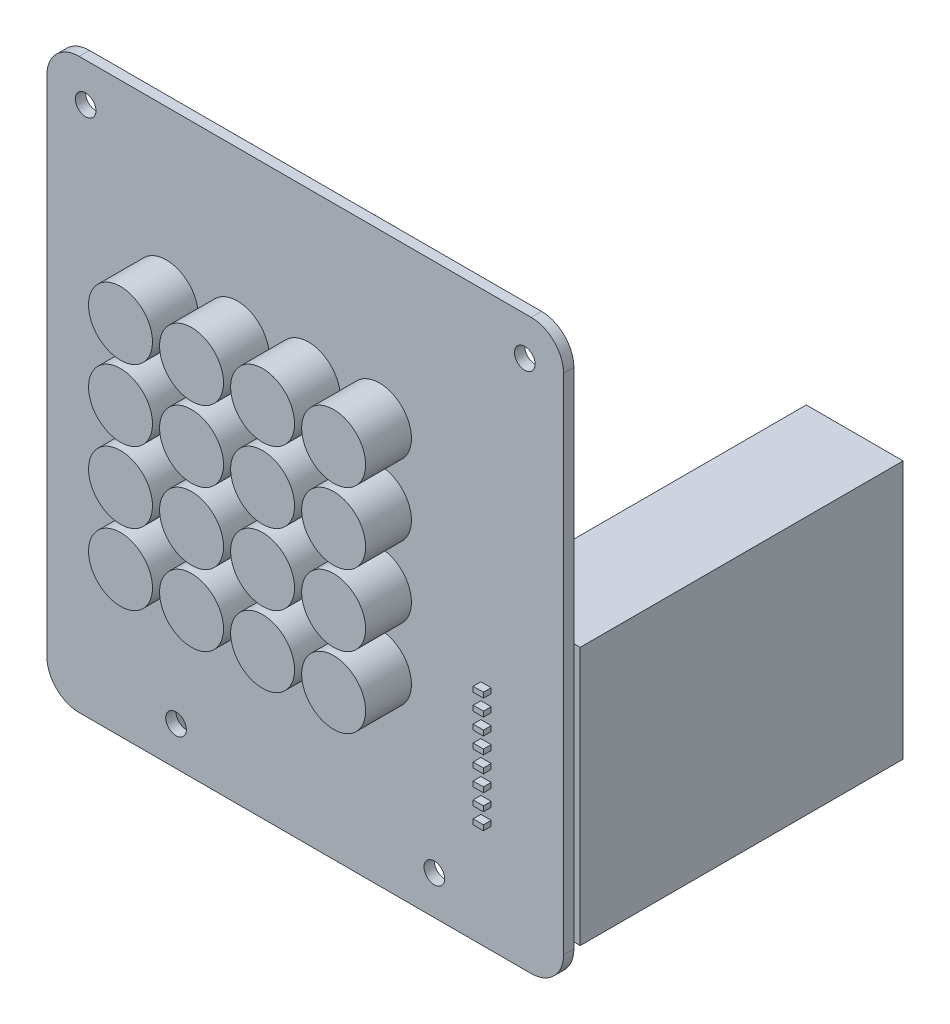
from build123d import *

# Parameters (mm, degrees)
SOURCE_PCB_OUTLINE_AND_HOLES_START             = -1.6
SKETCH_1_R                                     = 1.59999934
SOURCE_PCB_OUTLINE_AND_HOLES_DEPTH             = 1.6
NOMINAL_20MM_CAPACITOR_C1_START                = -21.6
SKETCH_2_R                                     = 6.25
NOMINAL_20MM_CAPACITOR_C1_DEPTH                = 20
ACOUSTIC_CASES_0_START                         = 3.5
SKETCH_3_R                                     = 4.95
ACOUSTIC_CASES_0_DEPTH                         = 7.1
ACOUSTIC_CASES_0_2_DEPTH                       = 7.1
ACOUSTIC_CASES_0_3_DEPTH                       = 7.1
ACOUSTIC_CASES_0_4_DEPTH                       = 7.1
ACOUSTIC_CASES_0_5_DEPTH                       = 7.1
ACOUSTIC_CASES_0_6_DEPTH                       = 7.1
ACOUSTIC_CASES_0_7_DEPTH                       = 7.1
ACOUSTIC_CASES_0_8_DEPTH                       = 7.1
ACOUSTIC_CASES_8_START                         = 3.5
SKETCH_4_R                                     = 4.95
ACOUSTIC_CASES_8_DEPTH                         = 7.1
ACOUSTIC_CASES_8_2_DEPTH                       = 7.1
ACOUSTIC_CASES_8_3_DEPTH                       = 7.1
ACOUSTIC_CASES_8_4_DEPTH                       = 7.1
ACOUSTIC_CASES_8_5_DEPTH                       = 7.1
ACOUSTIC_CASES_8_6_DEPTH                       = 7.1
ACOUSTIC_CASES_8_7_DEPTH                       = 7.1
ACOUSTIC_CASES_8_8_DEPTH                       = 7.1
COMPONENT_ENVELOPES_1_1_START                  = -2.9
SKETCH_5_W                                     = 1.999996
SKETCH_5_H                                     = 1.249985
COMPONENT_ENVELOPES_1_1_DEPTH                  = 1.3
COMPONENT_ENVELOPES_1_1_2_DEPTH                = 1.3
COMPONENT_ENVELOPES_1_1_3_DEPTH                = 1.3
COMPONENT_ENVELOPES_1_1_4_DEPTH                = 1.3
SKETCH_5_W_2                                   = 1.249985
SKETCH_5_H_2                                   = 1.999996
COMPONENT_ENVELOPES_1_1_5_DEPTH                = 1.3
COMPONENT_ENVELOPES_1_1_6_DEPTH                = 1.3
COMPONENT_ENVELOPES_1_1_7_DEPTH                = 1.3
COMPONENT_ENVELOPES_1_1_8_DEPTH                = 1.3
COMPONENT_ENVELOPES_1_2_START                  = -2.9
SKETCH_6_W                                     = 1.999996
SKETCH_6_H                                     = 1.249985
COMPONENT_ENVELOPES_1_2_DEPTH                  = 1.3
COMPONENT_ENVELOPES_1_2_2_DEPTH                = 1.3
COMPONENT_ENVELOPES_1_2_3_DEPTH                = 1.3
COMPONENT_ENVELOPES_1_2_4_DEPTH                = 1.3
SKETCH_6_W_2                                   = 1.249985
SKETCH_6_H_2                                   = 1.999996
COMPONENT_ENVELOPES_1_2_5_DEPTH                = 1.3
COMPONENT_ENVELOPES_1_2_6_DEPTH                = 1.3
COMPONENT_ENVELOPES_1_2_7_DEPTH                = 1.3
COMPONENT_ENVELOPES_1_2_8_DEPTH                = 1.3
COMPONENT_ENVELOPES_2_1_START                  = -16.6
SKETCH_7_W                                     = 8.799982
SKETCH_7_H                                     = 32.999934
COMPONENT_ENVELOPES_2_1_DEPTH                  = 15
COMPONENT_ENVELOPES_3_1_START                  = -2.8
SKETCH_8_W                                     = 1.599997
SKETCH_8_H                                     = 0.799998
COMPONENT_ENVELOPES_3_1_DEPTH                  = 1.2
COMPONENT_ENVELOPES_3_1_2_DEPTH                = 1.2
COMPONENT_ENVELOPES_3_1_3_DEPTH                = 1.2
COMPONENT_ENVELOPES_3_1_4_DEPTH                = 1.2
COMPONENT_ENVELOPES_3_1_5_DEPTH                = 1.2
COMPONENT_ENVELOPES_3_1_6_DEPTH                = 1.2
COMPONENT_ENVELOPES_3_1_7_DEPTH                = 1.2
COMPONENT_ENVELOPES_3_1_8_DEPTH                = 1.2
COMPONENT_ENVELOPES_3_2_START                  = -2.8
SKETCH_9_W                                     = 1.599997
SKETCH_9_H                                     = 0.799998
COMPONENT_ENVELOPES_3_2_DEPTH                  = 1.2
COMPONENT_ENVELOPES_3_2_2_DEPTH                = 1.2
COMPONENT_ENVELOPES_3_2_3_DEPTH                = 1.2
COMPONENT_ENVELOPES_3_2_4_DEPTH                = 1.2
SKETCH_9_W_2                                   = 0.799998
SKETCH_9_H_2                                   = 1.599997
COMPONENT_ENVELOPES_3_2_5_DEPTH                = 1.2
COMPONENT_ENVELOPES_3_2_6_DEPTH                = 1.2
COMPONENT_ENVELOPES_3_2_7_DEPTH                = 1.2
COMPONENT_ENVELOPES_3_2_8_DEPTH                = 1.2
COMPONENT_ENVELOPES_3_3_START                  = -2.8
SKETCH_10_W                                    = 0.799998
SKETCH_10_H                                    = 1.599997
COMPONENT_ENVELOPES_3_3_DEPTH                  = 1.2
COMPONENT_ENVELOPES_3_3_2_DEPTH                = 1.2
COMPONENT_ENVELOPES_3_3_3_DEPTH                = 1.2
COMPONENT_ENVELOPES_3_3_4_DEPTH                = 1.2
SKETCH_10_W_2                                  = 1.599997
SKETCH_10_H_2                                  = 0.799998
COMPONENT_ENVELOPES_3_3_5_DEPTH                = 1.2
COMPONENT_ENVELOPES_3_3_6_DEPTH                = 1.2
COMPONENT_ENVELOPES_3_3_7_DEPTH                = 1.2
COMPONENT_ENVELOPES_3_3_8_DEPTH                = 1.2
SKETCH_11_W                                    = 1.599997
SKETCH_11_H                                    = 0.799998
COMPONENT_ENVELOPES_4_1_DEPTH                  = 1.2
COMPONENT_ENVELOPES_4_1_2_DEPTH                = 1.2
COMPONENT_ENVELOPES_4_1_3_DEPTH                = 1.2
COMPONENT_ENVELOPES_4_1_4_DEPTH                = 1.2
COMPONENT_ENVELOPES_4_1_5_DEPTH                = 1.2
COMPONENT_ENVELOPES_4_1_6_DEPTH                = 1.2
COMPONENT_ENVELOPES_4_1_7_DEPTH                = 1.2
COMPONENT_ENVELOPES_4_1_8_DEPTH                = 1.2
COMPONENT_ENVELOPES_5_1_START                  = -3.3
SKETCH_12_W                                    = 3.042818
SKETCH_12_H                                    = 5.052416
COMPONENT_ENVELOPES_5_1_DEPTH                  = 1.7
COMPONENT_ENVELOPES_5_1_2_DEPTH                = 1.7
SKETCH_12_W_2                                  = 5.052416
SKETCH_12_H_2                                  = 3.042818
COMPONENT_ENVELOPES_5_1_3_DEPTH                = 1.7
COMPONENT_ENVELOPES_5_1_4_DEPTH                = 1.7
COMPONENT_ENVELOPES_5_1_5_DEPTH                = 1.7
COMPONENT_ENVELOPES_5_1_6_DEPTH                = 1.7
COMPONENT_ENVELOPES_5_1_7_DEPTH                = 1.7
COMPONENT_ENVELOPES_5_1_8_DEPTH                = 1.7
COMPONENT_ENVELOPES_6_1_START                  = -4.3
SKETCH_13_W                                    = 6.100013
SKETCH_13_H                                    = 2.690012
COMPONENT_ENVELOPES_6_1_DEPTH                  = 2.7
COMPONENT_ENVELOPES_7_1_START                  = -3.1
SKETCH_14_W                                    = 4.599991
SKETCH_14_H                                    = 3.599993
COMPONENT_ENVELOPES_7_1_DEPTH                  = 1.5
SKETCH_14_W_2                                  = 12.999974
SKETCH_14_H_2                                  = 4.79999
COMPONENT_ENVELOPES_7_1_2_DEPTH                = 1.5
COMPONENT_ENVELOPES_8_1_START                  = -11.6
SKETCH_15_W                                    = 13.299973
SKETCH_15_H                                    = 11.892357
COMPONENT_ENVELOPES_8_1_DEPTH                  = 10
ASSUMED_WIRED_CONNECTOR_BACK_KEEPOUT_50M_START = -51.6
SKETCH_16_W                                    = 15
SKETCH_16_H                                    = 40
ASSUMED_WIRED_CONNECTOR_BACK_KEEPOUT_50M_DEPTH = 50


with BuildPart() as part:
    # Sketch 1 → Source_PCB_outline_and_holes (new body)
    with BuildSketch(Plane.XY.offset(SOURCE_PCB_OUTLINE_AND_HOLES_START)):
        with BuildLine():
            Line((-33.5, -49.49999926), (36.50000002, -49.49999926))
            ThreePointArc((36.50000002, -49.49999926), (40.035533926, -48.035533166), (41.50000002, -44.49999926))
            Line((41.50000002, -44.49999926), (41.50000002, 33.5))
            ThreePointArc((41.50000002, 33.5), (40.035533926, 37.035533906), (36.50000002, 38.5))
            Line((36.50000002, 38.5), (-33.5, 38.5))
            ThreePointArc((-33.5, 38.5), (-37.035533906, 37.035533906), (-38.5, 33.5))
            Line((-38.5, 33.5), (-38.5, -44.49999926))
            ThreePointArc((-38.5, -44.49999926), (-37.035533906, -48.035533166), (-33.5, -49.49999926))
        make_face()
        with Locations((-32.499999, 32.499999)):
            Circle(SKETCH_1_R, mode=Mode.SUBTRACT)
        with Locations((35.500002, 32.499999)):
            Circle(SKETCH_1_R, mode=Mode.SUBTRACT)
        with Locations((21.500002, -43.500001)):
            Circle(SKETCH_1_R, mode=Mode.SUBTRACT)
        with Locations((-18.499999, -43.500001)):
            Circle(SKETCH_1_R, mode=Mode.SUBTRACT)
    extrude(amount=SOURCE_PCB_OUTLINE_AND_HOLES_DEPTH)


with BuildPart() as body_2:
    # Sketch 2 → Nominal_20mm_capacitor_C1 (new body)
    with BuildSketch(Plane.XY.offset(NOMINAL_20MM_CAPACITOR_C1_START)):
        with Locations((-29.023999, -20.760001)):
            Circle(SKETCH_2_R)
    extrude(amount=NOMINAL_20MM_CAPACITOR_C1_DEPTH)


with BuildPart() as body_3:
    # Sketch 3 → Acoustic_cases_0 (new body)
    with BuildSketch(Plane.XY.offset(ACOUSTIC_CASES_0_START)):
        with Locations((-16.499671, 16.499998)):
            Circle(SKETCH_3_R)
    extrude(amount=ACOUSTIC_CASES_0_DEPTH)


with BuildPart() as body_4:
    # Sketch 3 → Acoustic_cases_0 2 (new body)
    with BuildSketch(Plane.XY.offset(ACOUSTIC_CASES_0_START)):
        with Locations((-5.499568, 16.499998)):
            Circle(SKETCH_3_R)
    extrude(amount=ACOUSTIC_CASES_0_2_DEPTH)


with BuildPart() as body_5:
    # Sketch 3 → Acoustic_cases_0 3 (new body)
    with BuildSketch(Plane.XY.offset(ACOUSTIC_CASES_0_START)):
        with Locations((5.499983, 16.499998)):
            Circle(SKETCH_3_R)
    extrude(amount=ACOUSTIC_CASES_0_3_DEPTH)


with BuildPart() as body_6:
    # Sketch 3 → Acoustic_cases_0 4 (new body)
    with BuildSketch(Plane.XY.offset(ACOUSTIC_CASES_0_START)):
        with Locations((16.499814, 16.499998)):
            Circle(SKETCH_3_R)
    extrude(amount=ACOUSTIC_CASES_0_4_DEPTH)


with BuildPart() as body_7:
    # Sketch 3 → Acoustic_cases_0 5 (new body)
    with BuildSketch(Plane.XY.offset(ACOUSTIC_CASES_0_START)):
        with Locations((-16.49993, 5.5)):
            Circle(SKETCH_3_R)
    extrude(amount=ACOUSTIC_CASES_0_5_DEPTH)


with BuildPart() as body_8:
    # Sketch 3 → Acoustic_cases_0 6 (new body)
    with BuildSketch(Plane.XY.offset(ACOUSTIC_CASES_0_START)):
        with Locations((-5.499782, 5.5)):
            Circle(SKETCH_3_R)
    extrude(amount=ACOUSTIC_CASES_0_6_DEPTH)


with BuildPart() as body_9:
    # Sketch 3 → Acoustic_cases_0 7 (new body)
    with BuildSketch(Plane.XY.offset(ACOUSTIC_CASES_0_START)):
        with Locations((5.500293, 5.5)):
            Circle(SKETCH_3_R)
    extrude(amount=ACOUSTIC_CASES_0_7_DEPTH)


with BuildPart() as body_10:
    # Sketch 3 → Acoustic_cases_0 8 (new body)
    with BuildSketch(Plane.XY.offset(ACOUSTIC_CASES_0_START)):
        with Locations((16.499953, 5.5)):
            Circle(SKETCH_3_R)
    extrude(amount=ACOUSTIC_CASES_0_8_DEPTH)


with BuildPart() as body_11:
    # Sketch 4 → Acoustic_cases_8 (new body)
    with BuildSketch(Plane.XY.offset(ACOUSTIC_CASES_8_START)):
        with Locations((-16.499998, -5.500001)):
            Circle(SKETCH_4_R)
    extrude(amount=ACOUSTIC_CASES_8_DEPTH)


with BuildPart() as body_12:
    # Sketch 4 → Acoustic_cases_8 2 (new body)
    with BuildSketch(Plane.XY.offset(ACOUSTIC_CASES_8_START)):
        with Locations((-5.499665, -5.500001)):
            Circle(SKETCH_4_R)
    extrude(amount=ACOUSTIC_CASES_8_2_DEPTH)


with BuildPart() as body_13:
    # Sketch 4 → Acoustic_cases_8 3 (new body)
    with BuildSketch(Plane.XY.offset(ACOUSTIC_CASES_8_START)):
        with Locations((5.499668, -5.500001)):
            Circle(SKETCH_4_R)
    extrude(amount=ACOUSTIC_CASES_8_3_DEPTH)


with BuildPart() as body_14:
    # Sketch 4 → Acoustic_cases_8 4 (new body)
    with BuildSketch(Plane.XY.offset(ACOUSTIC_CASES_8_START)):
        with Locations((16.499953, -5.500001)):
            Circle(SKETCH_4_R)
    extrude(amount=ACOUSTIC_CASES_8_4_DEPTH)


with BuildPart() as body_15:
    # Sketch 4 → Acoustic_cases_8 5 (new body)
    with BuildSketch(Plane.XY.offset(ACOUSTIC_CASES_8_START)):
        with Locations((-16.499998, -16.500002)):
            Circle(SKETCH_4_R)
    extrude(amount=ACOUSTIC_CASES_8_5_DEPTH)


with BuildPart() as body_16:
    # Sketch 4 → Acoustic_cases_8 6 (new body)
    with BuildSketch(Plane.XY.offset(ACOUSTIC_CASES_8_START)):
        with Locations((-5.499782, -16.500002)):
            Circle(SKETCH_4_R)
    extrude(amount=ACOUSTIC_CASES_8_6_DEPTH)


with BuildPart() as body_17:
    # Sketch 4 → Acoustic_cases_8 7 (new body)
    with BuildSketch(Plane.XY.offset(ACOUSTIC_CASES_8_START)):
        with Locations((5.500293, -16.500002)):
            Circle(SKETCH_4_R)
    extrude(amount=ACOUSTIC_CASES_8_7_DEPTH)


with BuildPart() as body_18:
    # Sketch 4 → Acoustic_cases_8 8 (new body)
    with BuildSketch(Plane.XY.offset(ACOUSTIC_CASES_8_START)):
        with Locations((16.499953, -16.500002)):
            Circle(SKETCH_4_R)
    extrude(amount=ACOUSTIC_CASES_8_8_DEPTH)


with BuildPart() as body_19:
    # Sketch 5 → Component_envelopes_1_1 (new body)
    with BuildSketch(Plane.XY.offset(COMPONENT_ENVELOPES_1_1_START)):
        with Locations((-31.563999, 2.9889995)):
            Rectangle(SKETCH_5_W, SKETCH_5_H)
    extrude(amount=COMPONENT_ENVELOPES_1_1_DEPTH)


with BuildPart() as body_20:
    # Sketch 5 → Component_envelopes_1_1 2 (new body)
    with BuildSketch(Plane.XY.offset(COMPONENT_ENVELOPES_1_1_START)):
        with Locations((-31.563999, 5.4019995)):
            Rectangle(SKETCH_5_W, SKETCH_5_H)
    extrude(amount=COMPONENT_ENVELOPES_1_1_2_DEPTH)


with BuildPart() as body_21:
    # Sketch 5 → Component_envelopes_1_1 3 (new body)
    with BuildSketch(Plane.XY.offset(COMPONENT_ENVELOPES_1_1_START)):
        with Locations((26.221001, -6.0280005)):
            Rectangle(SKETCH_5_W, SKETCH_5_H)
    extrude(amount=COMPONENT_ENVELOPES_1_1_3_DEPTH)


with BuildPart() as body_22:
    # Sketch 5 → Component_envelopes_1_1 4 (new body)
    with BuildSketch(Plane.XY.offset(COMPONENT_ENVELOPES_1_1_START)):
        with Locations((26.221001, -8.5680005)):
            Rectangle(SKETCH_5_W, SKETCH_5_H)
    extrude(amount=COMPONENT_ENVELOPES_1_1_4_DEPTH)


with BuildPart() as body_23:
    # Sketch 5 → Component_envelopes_1_1 5 (new body)
    with BuildSketch(Plane.XY.offset(COMPONENT_ENVELOPES_1_1_START)):
        with Locations((-10.8629995, -35.492001)):
            Rectangle(SKETCH_5_W_2, SKETCH_5_H_2)
    extrude(amount=COMPONENT_ENVELOPES_1_1_5_DEPTH)


with BuildPart() as body_24:
    # Sketch 5 → Component_envelopes_1_1 6 (new body)
    with BuildSketch(Plane.XY.offset(COMPONENT_ENVELOPES_1_1_START)):
        with Locations((-7.8149995, -35.492001)):
            Rectangle(SKETCH_5_W_2, SKETCH_5_H_2)
    extrude(amount=COMPONENT_ENVELOPES_1_1_6_DEPTH)


with BuildPart() as body_25:
    # Sketch 5 → Component_envelopes_1_1 7 (new body)
    with BuildSketch(Plane.XY.offset(COMPONENT_ENVELOPES_1_1_START)):
        with Locations((11.3620005, -35.492001)):
            Rectangle(SKETCH_5_W_2, SKETCH_5_H_2)
    extrude(amount=COMPONENT_ENVELOPES_1_1_7_DEPTH)


with BuildPart() as body_26:
    # Sketch 5 → Component_envelopes_1_1 8 (new body)
    with BuildSketch(Plane.XY.offset(COMPONENT_ENVELOPES_1_1_START)):
        with Locations((14.5370005, -35.492001)):
            Rectangle(SKETCH_5_W_2, SKETCH_5_H_2)
    extrude(amount=COMPONENT_ENVELOPES_1_1_8_DEPTH)


with BuildPart() as body_27:
    # Sketch 6 → Component_envelopes_1_2 (new body)
    with BuildSketch(Plane.XY.offset(COMPONENT_ENVELOPES_1_2_START)):
        with Locations((26.221001, 6.4179995)):
            Rectangle(SKETCH_6_W, SKETCH_6_H)
    extrude(amount=COMPONENT_ENVELOPES_1_2_DEPTH)


with BuildPart() as body_28:
    # Sketch 6 → Component_envelopes_1_2 2 (new body)
    with BuildSketch(Plane.XY.offset(COMPONENT_ENVELOPES_1_2_START)):
        with Locations((26.221001, 3.6239995)):
            Rectangle(SKETCH_6_W, SKETCH_6_H)
    extrude(amount=COMPONENT_ENVELOPES_1_2_2_DEPTH)


with BuildPart() as body_29:
    # Sketch 6 → Component_envelopes_1_2 3 (new body)
    with BuildSketch(Plane.XY.offset(COMPONENT_ENVELOPES_1_2_START)):
        with Locations((-31.563999, 15.6889995)):
            Rectangle(SKETCH_6_W, SKETCH_6_H)
    extrude(amount=COMPONENT_ENVELOPES_1_2_3_DEPTH)


with BuildPart() as body_30:
    # Sketch 6 → Component_envelopes_1_2 4 (new body)
    with BuildSketch(Plane.XY.offset(COMPONENT_ENVELOPES_1_2_START)):
        with Locations((-31.563999, 18.4829995)):
            Rectangle(SKETCH_6_W, SKETCH_6_H)
    extrude(amount=COMPONENT_ENVELOPES_1_2_4_DEPTH)


with BuildPart() as body_31:
    # Sketch 6 → Component_envelopes_1_2 5 (new body)
    with BuildSketch(Plane.XY.offset(COMPONENT_ENVELOPES_1_2_START)):
        with Locations((5.6470005, 31.436999)):
            Rectangle(SKETCH_6_W_2, SKETCH_6_H_2)
    extrude(amount=COMPONENT_ENVELOPES_1_2_5_DEPTH)


with BuildPart() as body_32:
    # Sketch 6 → Component_envelopes_1_2 6 (new body)
    with BuildSketch(Plane.XY.offset(COMPONENT_ENVELOPES_1_2_START)):
        with Locations((3.1070005, 31.436999)):
            Rectangle(SKETCH_6_W_2, SKETCH_6_H_2)
    extrude(amount=COMPONENT_ENVELOPES_1_2_6_DEPTH)


with BuildPart() as body_33:
    # Sketch 6 → Component_envelopes_1_2 7 (new body)
    with BuildSketch(Plane.XY.offset(COMPONENT_ENVELOPES_1_2_START)):
        with Locations((-15.5619995, 31.436999)):
            Rectangle(SKETCH_6_W_2, SKETCH_6_H_2)
    extrude(amount=COMPONENT_ENVELOPES_1_2_7_DEPTH)


with BuildPart() as body_34:
    # Sketch 6 → Component_envelopes_1_2 8 (new body)
    with BuildSketch(Plane.XY.offset(COMPONENT_ENVELOPES_1_2_START)):
        with Locations((-18.1019995, 31.436999)):
            Rectangle(SKETCH_6_W_2, SKETCH_6_H_2)
    extrude(amount=COMPONENT_ENVELOPES_1_2_8_DEPTH)


with BuildPart() as body_35:
    # Sketch 7 → Component_envelopes_2_1 (new body)
    with BuildSketch(Plane.XY.offset(COMPONENT_ENVELOPES_2_1_START)):
        with Locations((34.984001, -23.554001)):
            Rectangle(SKETCH_7_W, SKETCH_7_H)
    extrude(amount=COMPONENT_ENVELOPES_2_1_DEPTH)


with BuildPart() as body_36:
    # Sketch 8 → Component_envelopes_3_1 (new body)
    with BuildSketch(Plane.XY.offset(COMPONENT_ENVELOPES_3_1_START)):
        with Locations((27.7536365, -32.444001)):
            Rectangle(SKETCH_8_W, SKETCH_8_H)
    extrude(amount=COMPONENT_ENVELOPES_3_1_DEPTH)


with BuildPart() as body_37:
    # Sketch 8 → Component_envelopes_3_1 2 (new body)
    with BuildSketch(Plane.XY.offset(COMPONENT_ENVELOPES_3_1_START)):
        with Locations((27.7536365, -29.904001)):
            Rectangle(SKETCH_8_W, SKETCH_8_H)
    extrude(amount=COMPONENT_ENVELOPES_3_1_2_DEPTH)


with BuildPart() as body_38:
    # Sketch 8 → Component_envelopes_3_1 3 (new body)
    with BuildSketch(Plane.XY.offset(COMPONENT_ENVELOPES_3_1_START)):
        with Locations((27.7536365, -27.364001)):
            Rectangle(SKETCH_8_W, SKETCH_8_H)
    extrude(amount=COMPONENT_ENVELOPES_3_1_3_DEPTH)


with BuildPart() as body_39:
    # Sketch 8 → Component_envelopes_3_1 4 (new body)
    with BuildSketch(Plane.XY.offset(COMPONENT_ENVELOPES_3_1_START)):
        with Locations((27.7536365, -24.824001)):
            Rectangle(SKETCH_8_W, SKETCH_8_H)
    extrude(amount=COMPONENT_ENVELOPES_3_1_4_DEPTH)


with BuildPart() as body_40:
    # Sketch 8 → Component_envelopes_3_1 5 (new body)
    with BuildSketch(Plane.XY.offset(COMPONENT_ENVELOPES_3_1_START)):
        with Locations((27.7450005, -19.744001)):
            Rectangle(SKETCH_8_W, SKETCH_8_H)
    extrude(amount=COMPONENT_ENVELOPES_3_1_5_DEPTH)


with BuildPart() as body_41:
    # Sketch 8 → Component_envelopes_3_1 6 (new body)
    with BuildSketch(Plane.XY.offset(COMPONENT_ENVELOPES_3_1_START)):
        with Locations((27.7450005, -17.204001)):
            Rectangle(SKETCH_8_W, SKETCH_8_H)
    extrude(amount=COMPONENT_ENVELOPES_3_1_6_DEPTH)


with BuildPart() as body_42:
    # Sketch 8 → Component_envelopes_3_1 7 (new body)
    with BuildSketch(Plane.XY.offset(COMPONENT_ENVELOPES_3_1_START)):
        with Locations((27.7450005, -22.284001)):
            Rectangle(SKETCH_8_W, SKETCH_8_H)
    extrude(amount=COMPONENT_ENVELOPES_3_1_7_DEPTH)


with BuildPart() as body_43:
    # Sketch 8 → Component_envelopes_3_1 8 (new body)
    with BuildSketch(Plane.XY.offset(COMPONENT_ENVELOPES_3_1_START)):
        with Locations((27.7450005, -14.664001)):
            Rectangle(SKETCH_8_W, SKETCH_8_H)
    extrude(amount=COMPONENT_ENVELOPES_3_1_8_DEPTH)


with BuildPart() as body_44:
    # Sketch 9 → Component_envelopes_3_2 (new body)
    with BuildSketch(Plane.XY.offset(COMPONENT_ENVELOPES_3_2_START)):
        with Locations((32.8250005, 11.116999)):
            Rectangle(SKETCH_9_W, SKETCH_9_H)
    extrude(amount=COMPONENT_ENVELOPES_3_2_DEPTH)


with BuildPart() as body_45:
    # Sketch 9 → Component_envelopes_3_2 2 (new body)
    with BuildSketch(Plane.XY.offset(COMPONENT_ENVELOPES_3_2_START)):
        with Locations((32.8250005, 8.576999)):
            Rectangle(SKETCH_9_W, SKETCH_9_H)
    extrude(amount=COMPONENT_ENVELOPES_3_2_2_DEPTH)


with BuildPart() as body_46:
    # Sketch 9 → Component_envelopes_3_2 3 (new body)
    with BuildSketch(Plane.XY.offset(COMPONENT_ENVELOPES_3_2_START)):
        with Locations((-36.3899995, 10.481999)):
            Rectangle(SKETCH_9_W, SKETCH_9_H)
    extrude(amount=COMPONENT_ENVELOPES_3_2_3_DEPTH)


with BuildPart() as body_47:
    # Sketch 9 → Component_envelopes_3_2 4 (new body)
    with BuildSketch(Plane.XY.offset(COMPONENT_ENVELOPES_3_2_START)):
        with Locations((-36.2629995, 13.021999)):
            Rectangle(SKETCH_9_W, SKETCH_9_H)
    extrude(amount=COMPONENT_ENVELOPES_3_2_4_DEPTH)


with BuildPart() as body_48:
    # Sketch 9 → Component_envelopes_3_2 5 (new body)
    with BuildSketch(Plane.XY.offset(COMPONENT_ENVELOPES_3_2_START)):
        with Locations((9.584001, 36.5169995)):
            Rectangle(SKETCH_9_W_2, SKETCH_9_H_2)
    extrude(amount=COMPONENT_ENVELOPES_3_2_5_DEPTH)


with BuildPart() as body_49:
    # Sketch 9 → Component_envelopes_3_2 6 (new body)
    with BuildSketch(Plane.XY.offset(COMPONENT_ENVELOPES_3_2_START)):
        with Locations((12.124001, 36.5169995)):
            Rectangle(SKETCH_9_W_2, SKETCH_9_H_2)
    extrude(amount=COMPONENT_ENVELOPES_3_2_6_DEPTH)


with BuildPart() as body_50:
    # Sketch 9 → Component_envelopes_3_2 7 (new body)
    with BuildSketch(Plane.XY.offset(COMPONENT_ENVELOPES_3_2_START)):
        with Locations((-12.132999, 36.5169995)):
            Rectangle(SKETCH_9_W_2, SKETCH_9_H_2)
    extrude(amount=COMPONENT_ENVELOPES_3_2_7_DEPTH)


with BuildPart() as body_51:
    # Sketch 9 → Component_envelopes_3_2 8 (new body)
    with BuildSketch(Plane.XY.offset(COMPONENT_ENVELOPES_3_2_START)):
        with Locations((-9.592999, 36.5169995)):
            Rectangle(SKETCH_9_W_2, SKETCH_9_H_2)
    extrude(amount=COMPONENT_ENVELOPES_3_2_8_DEPTH)


with BuildPart() as body_52:
    # Sketch 10 → Component_envelopes_3_3 (new body)
    with BuildSketch(Plane.XY.offset(COMPONENT_ENVELOPES_3_3_START)):
        with Locations((10.092001, -22.5886865)):
            Rectangle(SKETCH_10_W, SKETCH_10_H)
    extrude(amount=COMPONENT_ENVELOPES_3_3_DEPTH)


with BuildPart() as body_53:
    # Sketch 10 → Component_envelopes_3_3 2 (new body)
    with BuildSketch(Plane.XY.offset(COMPONENT_ENVELOPES_3_3_START)):
        with Locations((12.632001, -22.5886865)):
            Rectangle(SKETCH_10_W, SKETCH_10_H)
    extrude(amount=COMPONENT_ENVELOPES_3_3_2_DEPTH)


with BuildPart() as body_54:
    # Sketch 10 → Component_envelopes_3_3 3 (new body)
    with BuildSketch(Plane.XY.offset(COMPONENT_ENVELOPES_3_3_START)):
        with Locations((-12.132999, -22.5886865)):
            Rectangle(SKETCH_10_W, SKETCH_10_H)
    extrude(amount=COMPONENT_ENVELOPES_3_3_3_DEPTH)


with BuildPart() as body_55:
    # Sketch 10 → Component_envelopes_3_3 4 (new body)
    with BuildSketch(Plane.XY.offset(COMPONENT_ENVELOPES_3_3_START)):
        with Locations((-9.592999, -22.5886865)):
            Rectangle(SKETCH_10_W, SKETCH_10_H)
    extrude(amount=COMPONENT_ENVELOPES_3_3_4_DEPTH)


with BuildPart() as body_56:
    # Sketch 10 → Component_envelopes_3_3 5 (new body)
    with BuildSketch(Plane.XY.offset(COMPONENT_ENVELOPES_3_3_START)):
        with Locations((32.8250005, -1.202001)):
            Rectangle(SKETCH_10_W_2, SKETCH_10_H_2)
    extrude(amount=COMPONENT_ENVELOPES_3_3_5_DEPTH)


with BuildPart() as body_57:
    # Sketch 10 → Component_envelopes_3_3 6 (new body)
    with BuildSketch(Plane.XY.offset(COMPONENT_ENVELOPES_3_3_START)):
        with Locations((32.8250005, -3.742001)):
            Rectangle(SKETCH_10_W_2, SKETCH_10_H_2)
    extrude(amount=COMPONENT_ENVELOPES_3_3_6_DEPTH)


with BuildPart() as body_58:
    # Sketch 10 → Component_envelopes_3_3 7 (new body)
    with BuildSketch(Plane.XY.offset(COMPONENT_ENVELOPES_3_3_START)):
        with Locations((-36.7709995, -1.710001)):
            Rectangle(SKETCH_10_W_2, SKETCH_10_H_2)
    extrude(amount=COMPONENT_ENVELOPES_3_3_7_DEPTH)


with BuildPart() as body_59:
    # Sketch 10 → Component_envelopes_3_3 8 (new body)
    with BuildSketch(Plane.XY.offset(COMPONENT_ENVELOPES_3_3_START)):
        with Locations((-36.7709995, 0.829999)):
            Rectangle(SKETCH_10_W_2, SKETCH_10_H_2)
    extrude(amount=COMPONENT_ENVELOPES_3_3_8_DEPTH)


with BuildPart() as body_60:
    # Sketch 11 → Component_envelopes_4_1 (new body)
    with BuildSketch(Plane.XY):
        with Locations((29.5000015, -32.444001)):
            Rectangle(SKETCH_11_W, SKETCH_11_H)
    extrude(amount=COMPONENT_ENVELOPES_4_1_DEPTH)


with BuildPart() as body_61:
    # Sketch 11 → Component_envelopes_4_1 2 (new body)
    with BuildSketch(Plane.XY):
        with Locations((29.5000015, -29.904001)):
            Rectangle(SKETCH_11_W, SKETCH_11_H)
    extrude(amount=COMPONENT_ENVELOPES_4_1_2_DEPTH)


with BuildPart() as body_62:
    # Sketch 11 → Component_envelopes_4_1 3 (new body)
    with BuildSketch(Plane.XY):
        with Locations((29.5000015, -27.364001)):
            Rectangle(SKETCH_11_W, SKETCH_11_H)
    extrude(amount=COMPONENT_ENVELOPES_4_1_3_DEPTH)


with BuildPart() as body_63:
    # Sketch 11 → Component_envelopes_4_1 4 (new body)
    with BuildSketch(Plane.XY):
        with Locations((29.5000015, -24.824001)):
            Rectangle(SKETCH_11_W, SKETCH_11_H)
    extrude(amount=COMPONENT_ENVELOPES_4_1_4_DEPTH)


with BuildPart() as body_64:
    # Sketch 11 → Component_envelopes_4_1 5 (new body)
    with BuildSketch(Plane.XY):
        with Locations((29.5000015, -19.744001)):
            Rectangle(SKETCH_11_W, SKETCH_11_H)
    extrude(amount=COMPONENT_ENVELOPES_4_1_5_DEPTH)


with BuildPart() as body_65:
    # Sketch 11 → Component_envelopes_4_1 6 (new body)
    with BuildSketch(Plane.XY):
        with Locations((29.5000015, -17.204001)):
            Rectangle(SKETCH_11_W, SKETCH_11_H)
    extrude(amount=COMPONENT_ENVELOPES_4_1_6_DEPTH)


with BuildPart() as body_66:
    # Sketch 11 → Component_envelopes_4_1 7 (new body)
    with BuildSketch(Plane.XY):
        with Locations((29.5000015, -22.284001)):
            Rectangle(SKETCH_11_W, SKETCH_11_H)
    extrude(amount=COMPONENT_ENVELOPES_4_1_7_DEPTH)


with BuildPart() as body_67:
    # Sketch 11 → Component_envelopes_4_1 8 (new body)
    with BuildSketch(Plane.XY):
        with Locations((29.5000015, -14.664001)):
            Rectangle(SKETCH_11_W, SKETCH_11_H)
    extrude(amount=COMPONENT_ENVELOPES_4_1_8_DEPTH)


with BuildPart() as body_68:
    # Sketch 12 → Component_envelopes_5_1 (new body)
    with BuildSketch(Plane.XY.offset(COMPONENT_ENVELOPES_5_1_START)):
        with Locations((-30.420999, -1.075001)):
            Rectangle(SKETCH_12_W, SKETCH_12_H)
    extrude(amount=COMPONENT_ENVELOPES_5_1_DEPTH)


with BuildPart() as body_69:
    # Sketch 12 → Component_envelopes_5_1 2 (new body)
    with BuildSketch(Plane.XY.offset(COMPONENT_ENVELOPES_5_1_START)):
        with Locations((25.459001, -1.837001)):
            Rectangle(SKETCH_12_W, SKETCH_12_H)
    extrude(amount=COMPONENT_ENVELOPES_5_1_2_DEPTH)


with BuildPart() as body_70:
    # Sketch 12 → Component_envelopes_5_1 3 (new body)
    with BuildSketch(Plane.XY.offset(COMPONENT_ENVELOPES_5_1_START)):
        with Locations((-11.497999, -27.999001)):
            Rectangle(SKETCH_12_W_2, SKETCH_12_H_2)
    extrude(amount=COMPONENT_ENVELOPES_5_1_3_DEPTH)


with BuildPart() as body_71:
    # Sketch 12 → Component_envelopes_5_1 4 (new body)
    with BuildSketch(Plane.XY.offset(COMPONENT_ENVELOPES_5_1_START)):
        with Locations((10.727001, -27.999001)):
            Rectangle(SKETCH_12_W_2, SKETCH_12_H_2)
    extrude(amount=COMPONENT_ENVELOPES_5_1_4_DEPTH)


with BuildPart() as body_72:
    # Sketch 12 → Component_envelopes_5_1 5 (new body)
    with BuildSketch(Plane.XY.offset(COMPONENT_ENVELOPES_5_1_START)):
        with Locations((-11.497999, 30.420999)):
            Rectangle(SKETCH_12_W_2, SKETCH_12_H_2)
    extrude(amount=COMPONENT_ENVELOPES_5_1_5_DEPTH)


with BuildPart() as body_73:
    # Sketch 12 → Component_envelopes_5_1 6 (new body)
    with BuildSketch(Plane.XY.offset(COMPONENT_ENVELOPES_5_1_START)):
        with Locations((10.219001, 30.420999)):
            Rectangle(SKETCH_12_W_2, SKETCH_12_H_2)
    extrude(amount=COMPONENT_ENVELOPES_5_1_6_DEPTH)


with BuildPart() as body_74:
    # Sketch 12 → Component_envelopes_5_1 7 (new body)
    with BuildSketch(Plane.XY.offset(COMPONENT_ENVELOPES_5_1_START)):
        with Locations((-30.039999, 11.116999)):
            Rectangle(SKETCH_12_W, SKETCH_12_H)
    extrude(amount=COMPONENT_ENVELOPES_5_1_7_DEPTH)


with BuildPart() as body_75:
    # Sketch 12 → Component_envelopes_5_1 8 (new body)
    with BuildSketch(Plane.XY.offset(COMPONENT_ENVELOPES_5_1_START)):
        with Locations((25.459001, 10.481999)):
            Rectangle(SKETCH_12_W, SKETCH_12_H)
    extrude(amount=COMPONENT_ENVELOPES_5_1_8_DEPTH)


with BuildPart() as body_76:
    # Sketch 13 → Component_envelopes_6_1 (new body)
    with BuildSketch(Plane.XY.offset(COMPONENT_ENVELOPES_6_1_START)):
        with Locations((-10.9899995, -43.620001)):
            Rectangle(SKETCH_13_W, SKETCH_13_H)
    extrude(amount=COMPONENT_ENVELOPES_6_1_DEPTH)


with BuildPart() as body_77:
    # Sketch 14 → Component_envelopes_7_1 (new body)
    with BuildSketch(Plane.XY.offset(COMPONENT_ENVELOPES_7_1_START)):
        with Locations((15.1720005, -40.3180005)):
            Rectangle(SKETCH_14_W, SKETCH_14_H)
    extrude(amount=COMPONENT_ENVELOPES_7_1_DEPTH)


with BuildPart() as body_78:
    # Sketch 14 → Component_envelopes_7_1 2 (new body)
    with BuildSketch(Plane.XY.offset(COMPONENT_ENVELOPES_7_1_START)):
        with Locations((4.250001, -44.382001)):
            Rectangle(SKETCH_14_W_2, SKETCH_14_H_2)
    extrude(amount=COMPONENT_ENVELOPES_7_1_2_DEPTH)


with BuildPart() as body_79:
    # Sketch 15 → Component_envelopes_8_1 (new body)
    with BuildSketch(Plane.XY.offset(COMPONENT_ENVELOPES_8_1_START)):
        with Locations((-29.0239865, -43.5598155)):
            Rectangle(SKETCH_15_W, SKETCH_15_H)
    extrude(amount=COMPONENT_ENVELOPES_8_1_DEPTH)


with BuildPart() as body_80:
    # Sketch 16 → ASSUMED_wired_connector_back_keepout_50m (new body)
    with BuildSketch(Plane.XY.offset(ASSUMED_WIRED_CONNECTOR_BACK_KEEPOUT_50M_START)):
        with Locations((34.984001, -23.554001)):
            Rectangle(SKETCH_16_W, SKETCH_16_H)
    extrude(amount=ASSUMED_WIRED_CONNECTOR_BACK_KEEPOUT_50M_DEPTH)


solid = Compound([part.part, body_2.part, body_3.part, body_4.part, body_5.part, body_6.part, body_7.part, body_8.part, body_9.part, body_10.part, body_11.part, body_12.part, body_13.part, body_14.part, body_15.part, body_16.part, body_17.part, body_18.part, body_19.part, body_20.part, body_21.part, body_22.part, body_23.part, body_24.part, body_25.part, body_26.part, body_27.part, body_28.part, body_29.part, body_30.part, body_31.part, body_32.part, body_33.part, body_34.part, body_35.part, body_36.part, body_37.part, body_38.part, body_39.part, body_40.part, body_41.part, body_42.part, body_43.part, body_44.part, body_45.part, body_46.part, body_47.part, body_48.part, body_49.part, body_50.part, body_51.part, body_52.part, body_53.part, body_54.part, body_55.part, body_56.part, body_57.part, body_58.part, body_59.part, body_60.part, body_61.part, body_62.part, body_63.part, body_64.part, body_65.part, body_66.part, body_67.part, body_68.part, body_69.part, body_70.part, body_71.part, body_72.part, body_73.part, body_74.part, body_75.part, body_76.part, body_77.part, body_78.part, body_79.part, body_80.part])
